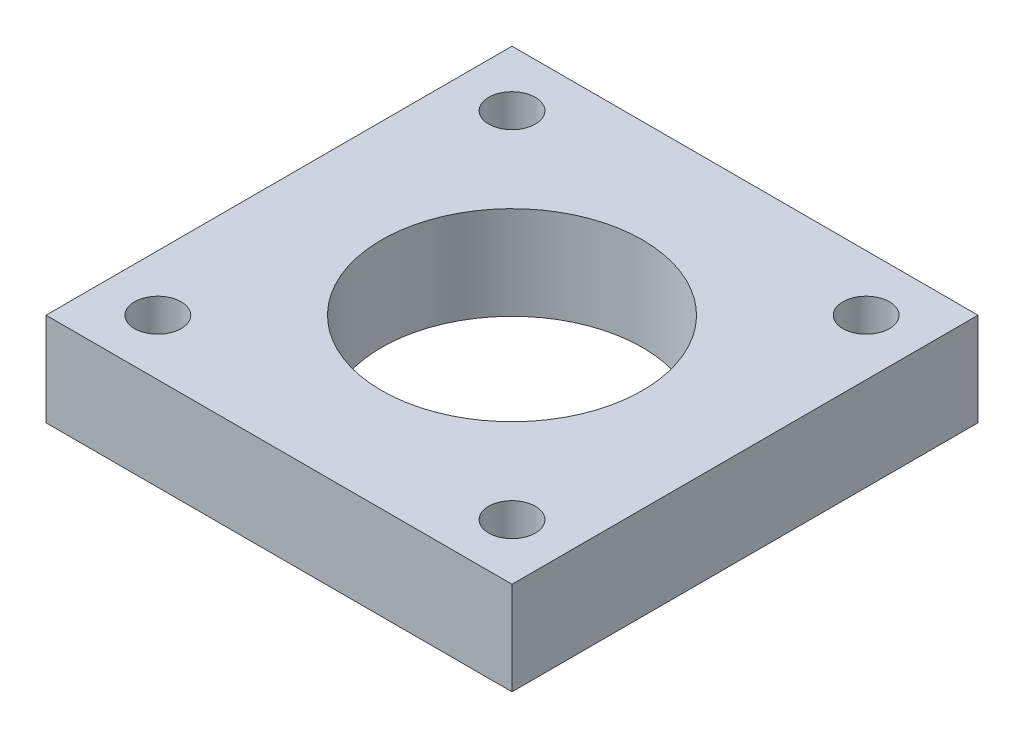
from build123d import *

# Parameters (mm, degrees)
SKETCH_1_W            = 50
SKETCH_1_H            = 50
EXTRUDE_1_DEPTH       = 10
HOLE_WIZARD_M61_D     = 5
HOLE_WIZARD_M61_DEPTH = 10
HOLE_WIZARD_M61_TIP   = 1.502151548
M30X2_01_D            = 28
M30X2_01_DEPTH        = 10
M30X2_01_TIP          = 8.412048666


with BuildPart() as part:
    # Sketch 1 → Extrude 1 (new body)
    with BuildSketch(Plane(origin=(0, 0, 0), x_dir=(1, 0, 0), z_dir=(0, 1, 0))):
        Rectangle(SKETCH_1_W, SKETCH_1_H)
    extrude(amount=EXTRUDE_1_DEPTH)

    # Hole Wizard M61
    with Locations(Plane(origin=(0, 10, 0), x_dir=(1, 0, 0), z_dir=(0, 1, 0))):
        with Locations((-19, 19), (19, 19), (19, -19), (-19, -19)):
            Hole(HOLE_WIZARD_M61_D / 2, depth=HOLE_WIZARD_M61_DEPTH)
            with Locations((0, 0, -(HOLE_WIZARD_M61_DEPTH + HOLE_WIZARD_M61_TIP / 2))):  # 118° drill point
                Cone(0, HOLE_WIZARD_M61_D / 2, HOLE_WIZARD_M61_TIP, mode=Mode.SUBTRACT)

    # M30x2.01
    with Locations(Plane(origin=(0, 10, 0), x_dir=(1, 0, 0), z_dir=(0, 1, 0))):
        with Locations((0, 0)):
            Hole(M30X2_01_D / 2, depth=M30X2_01_DEPTH)
            with Locations((0, 0, -(M30X2_01_DEPTH + M30X2_01_TIP / 2))):  # 118° drill point
                Cone(0, M30X2_01_D / 2, M30X2_01_TIP, mode=Mode.SUBTRACT)


solid = part.part
